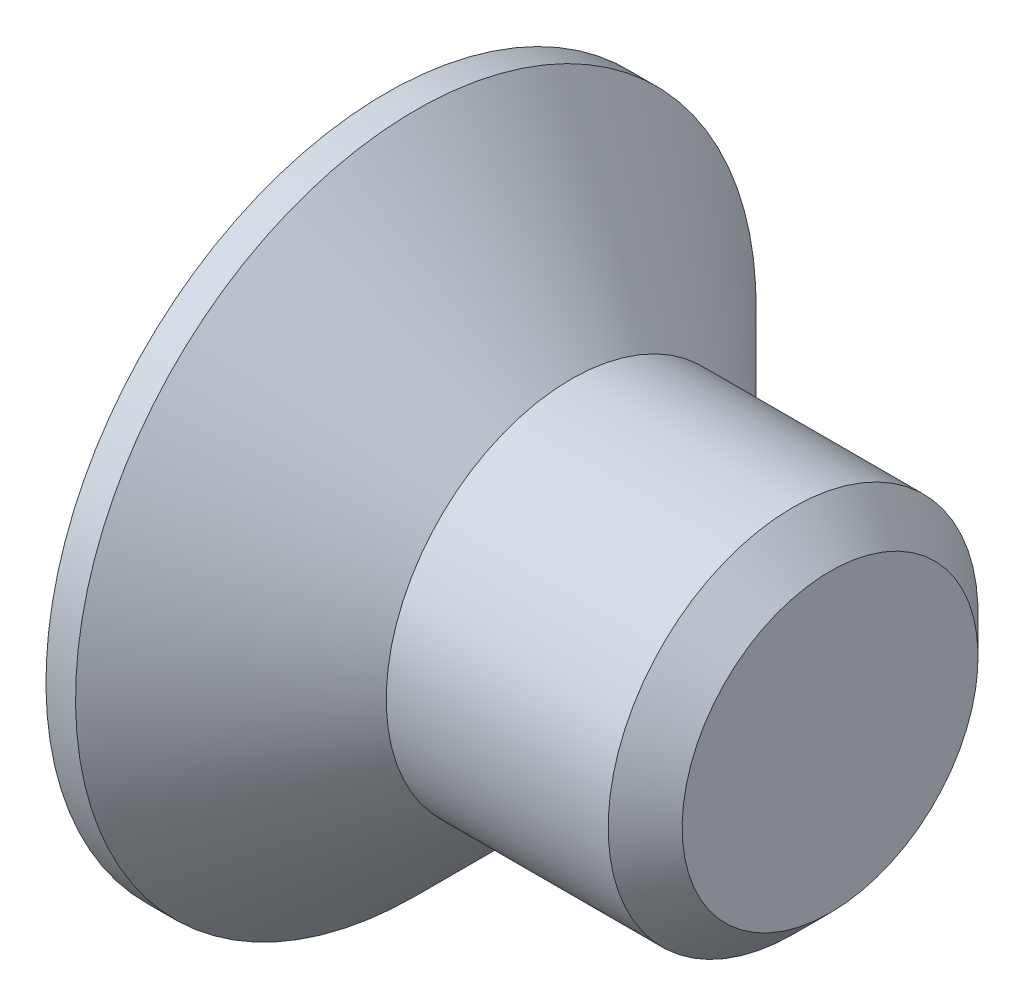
ISO-10303-21;
HEADER;
FILE_DESCRIPTION(('STEP AP214'),'2;1');
FILE_NAME('part.step','',(''),(''),'','','');
FILE_SCHEMA(('AUTOMOTIVE_DESIGN { 1 0 10303 214 1 1 1 1 }'));
ENDSEC;
DATA;
#1=APPLICATION_CONTEXT('core data for automotive mechanical design processes');
#2=APPLICATION_PROTOCOL_DEFINITION('international standard','automotive_design',2000,#1);
#3=PRODUCT_CONTEXT('',#1,'mechanical');
#4=PRODUCT('Part','Part','',(#3));
#5=PRODUCT_RELATED_PRODUCT_CATEGORY('part','',(#4));
#6=PRODUCT_DEFINITION_FORMATION('','',#4);
#7=PRODUCT_DEFINITION_CONTEXT('part definition',#1,'design');
#8=PRODUCT_DEFINITION('design','',#6,#7);
#9=PRODUCT_DEFINITION_SHAPE('','',#8);
#10=(LENGTH_UNIT() NAMED_UNIT(*) SI_UNIT(.MILLI.,.METRE.));
#11=(NAMED_UNIT(*) PLANE_ANGLE_UNIT() SI_UNIT($,.RADIAN.));
#12=(NAMED_UNIT(*) SI_UNIT($,.STERADIAN.) SOLID_ANGLE_UNIT());
#13=UNCERTAINTY_MEASURE_WITH_UNIT(LENGTH_MEASURE(1.E-05),#10,'distance_accuracy_value','');
#14=(GEOMETRIC_REPRESENTATION_CONTEXT(3) GLOBAL_UNCERTAINTY_ASSIGNED_CONTEXT((#13)) GLOBAL_UNIT_ASSIGNED_CONTEXT((#10,
#11,#12)) REPRESENTATION_CONTEXT('',''));
#15=CARTESIAN_POINT('',(0.,0.,0.));
#16=DIRECTION('',(0.,0.,1.));
#17=DIRECTION('',(1.,0.,0.));
#18=AXIS2_PLACEMENT_3D('',#15,#16,#17);
#19=CARTESIAN_POINT('',(0.,0.,0.));
#20=DIRECTION('',(-1.,0.,0.));
#21=DIRECTION('',(0.,-1.,0.));
#22=AXIS2_PLACEMENT_3D('',#19,#20,#21);
#23=CONICAL_SURFACE('',#22,2.5,0.78539816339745);
#24=CARTESIAN_POINT('',(-2.09999999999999,0.,0.));
#25=DIRECTION('',(-1.,0.,0.));
#26=DIRECTION('',(0.,-1.,0.));
#27=AXIS2_PLACEMENT_3D('',#24,#25,#26);
#28=CIRCLE('',#27,4.6);
#29=CARTESIAN_POINT('',(-2.09999999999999,-4.6,0.));
#30=VERTEX_POINT('',#29);
#31=EDGE_CURVE('E189',#30,#30,#28,.T.);
#32=ORIENTED_EDGE('',*,*,#31,.F.);
#33=EDGE_LOOP('',(#32));
#34=FACE_BOUND('',#33,.T.);
#35=CARTESIAN_POINT('',(0.,0.,0.));
#36=DIRECTION('',(-1.,0.,0.));
#37=DIRECTION('',(0.,-1.,0.));
#38=AXIS2_PLACEMENT_3D('',#35,#36,#37);
#39=CIRCLE('',#38,2.5);
#40=CARTESIAN_POINT('',(0.,-2.5,0.));
#41=VERTEX_POINT('',#40);
#42=EDGE_CURVE('E212',#41,#41,#39,.T.);
#43=ORIENTED_EDGE('',*,*,#42,.T.);
#44=EDGE_LOOP('',(#43));
#45=FACE_BOUND('',#44,.T.);
#46=ADVANCED_FACE('F33',(#34,#45),#23,.T.);
#47=CARTESIAN_POINT('',(-2.5,0.,0.));
#48=DIRECTION('',(-1.,0.,0.));
#49=DIRECTION('',(0.,-1.,0.));
#50=AXIS2_PLACEMENT_3D('',#47,#48,#49);
#51=CYLINDRICAL_SURFACE('',#50,2.5);
#52=CARTESIAN_POINT('',(3.,0.,0.));
#53=DIRECTION('',(-1.,0.,0.));
#54=DIRECTION('',(0.,-1.,0.));
#55=AXIS2_PLACEMENT_3D('',#52,#53,#54);
#56=CIRCLE('',#55,2.5);
#57=CARTESIAN_POINT('',(3.,-2.5,0.));
#58=VERTEX_POINT('',#57);
#59=EDGE_CURVE('E41',#58,#58,#56,.T.);
#60=ORIENTED_EDGE('',*,*,#59,.T.);
#61=EDGE_LOOP('',(#60));
#62=FACE_BOUND('',#61,.T.);
#63=ORIENTED_EDGE('',*,*,#42,.F.);
#64=EDGE_LOOP('',(#63));
#65=FACE_BOUND('',#64,.T.);
#66=ADVANCED_FACE('F217',(#62,#65),#51,.T.);
#67=CARTESIAN_POINT('',(3.5,0.,0.));
#68=DIRECTION('',(-1.,0.,0.));
#69=DIRECTION('',(0.,-1.,0.));
#70=AXIS2_PLACEMENT_3D('',#67,#68,#69);
#71=PLANE('',#70);
#72=CARTESIAN_POINT('',(3.5,0.,0.));
#73=DIRECTION('',(-1.,0.,0.));
#74=DIRECTION('',(0.,-1.,0.));
#75=AXIS2_PLACEMENT_3D('',#72,#73,#74);
#76=CIRCLE('',#75,2.);
#77=CARTESIAN_POINT('',(3.5,-2.,0.));
#78=VERTEX_POINT('',#77);
#79=EDGE_CURVE('E11',#78,#78,#76,.F.);
#80=ORIENTED_EDGE('',*,*,#79,.T.);
#81=EDGE_LOOP('',(#80));
#82=FACE_BOUND('',#81,.T.);
#83=ADVANCED_FACE('F239',(#82),#71,.F.);
#84=CARTESIAN_POINT('',(-2.5,4.6,0.));
#85=DIRECTION('',(1.,0.,0.));
#86=DIRECTION('',(0.,1.,0.));
#87=AXIS2_PLACEMENT_3D('',#84,#85,#86);
#88=PLANE('',#87);
#89=DIRECTION('',(0.,0.,-1.));
#90=VECTOR('',#89,1.);
#91=CARTESIAN_POINT('',(-2.5,0.575,-2.3));
#92=LINE('',#91,#90);
#93=CARTESIAN_POINT('',(-2.5,0.575,-0.575));
#94=VERTEX_POINT('',#93);
#95=CARTESIAN_POINT('',(-2.5,0.575,-2.3));
#96=VERTEX_POINT('',#95);
#97=EDGE_CURVE('E158',#94,#96,#92,.T.);
#98=ORIENTED_EDGE('',*,*,#97,.F.);
#99=DIRECTION('',(0.,-1.,0.));
#100=VECTOR('',#99,1.);
#101=CARTESIAN_POINT('',(-2.5,0.575,-0.575));
#102=LINE('',#101,#100);
#103=CARTESIAN_POINT('',(-2.5,2.3,-0.575));
#104=VERTEX_POINT('',#103);
#105=EDGE_CURVE('E48',#104,#94,#102,.T.);
#106=ORIENTED_EDGE('',*,*,#105,.F.);
#107=DIRECTION('',(0.,0.,-1.));
#108=VECTOR('',#107,1.);
#109=CARTESIAN_POINT('',(-2.5,2.3,-0.575));
#110=LINE('',#109,#108);
#111=CARTESIAN_POINT('',(-2.5,2.3,0.575));
#112=VERTEX_POINT('',#111);
#113=EDGE_CURVE('E185',#112,#104,#110,.T.);
#114=ORIENTED_EDGE('',*,*,#113,.F.);
#115=DIRECTION('',(0.,1.,0.));
#116=VECTOR('',#115,1.);
#117=CARTESIAN_POINT('',(-2.5,2.3,0.575));
#118=LINE('',#117,#116);
#119=CARTESIAN_POINT('',(-2.5,0.575,0.575));
#120=VERTEX_POINT('',#119);
#121=EDGE_CURVE('E183',#120,#112,#118,.T.);
#122=ORIENTED_EDGE('',*,*,#121,.F.);
#123=DIRECTION('',(0.,0.,-1.));
#124=VECTOR('',#123,1.);
#125=CARTESIAN_POINT('',(-2.5,0.575,0.575));
#126=LINE('',#125,#124);
#127=CARTESIAN_POINT('',(-2.5,0.575,2.3));
#128=VERTEX_POINT('',#127);
#129=EDGE_CURVE('E132',#128,#120,#126,.T.);
#130=ORIENTED_EDGE('',*,*,#129,.F.);
#131=DIRECTION('',(0.,1.,0.));
#132=VECTOR('',#131,1.);
#133=CARTESIAN_POINT('',(-2.5,0.575,2.3));
#134=LINE('',#133,#132);
#135=CARTESIAN_POINT('',(-2.5,-0.575,2.3));
#136=VERTEX_POINT('',#135);
#137=EDGE_CURVE('E179',#136,#128,#134,.T.);
#138=ORIENTED_EDGE('',*,*,#137,.F.);
#139=DIRECTION('',(0.,0.,1.));
#140=VECTOR('',#139,1.);
#141=CARTESIAN_POINT('',(-2.5,-0.575,2.3));
#142=LINE('',#141,#140);
#143=CARTESIAN_POINT('',(-2.5,-0.575,0.575));
#144=VERTEX_POINT('',#143);
#145=EDGE_CURVE('E176',#144,#136,#142,.T.);
#146=ORIENTED_EDGE('',*,*,#145,.F.);
#147=DIRECTION('',(0.,1.,0.));
#148=VECTOR('',#147,1.);
#149=CARTESIAN_POINT('',(-2.5,-0.575,0.575));
#150=LINE('',#149,#148);
#151=CARTESIAN_POINT('',(-2.5,-2.3,0.575));
#152=VERTEX_POINT('',#151);
#153=EDGE_CURVE('E173',#152,#144,#150,.T.);
#154=ORIENTED_EDGE('',*,*,#153,.F.);
#155=DIRECTION('',(0.,0.,1.));
#156=VECTOR('',#155,1.);
#157=CARTESIAN_POINT('',(-2.5,-2.3,0.575));
#158=LINE('',#157,#156);
#159=CARTESIAN_POINT('',(-2.5,-2.3,-0.575));
#160=VERTEX_POINT('',#159);
#161=EDGE_CURVE('E170',#160,#152,#158,.T.);
#162=ORIENTED_EDGE('',*,*,#161,.F.);
#163=DIRECTION('',(0.,-1.,0.));
#164=VECTOR('',#163,1.);
#165=CARTESIAN_POINT('',(-2.5,-2.3,-0.575));
#166=LINE('',#165,#164);
#167=CARTESIAN_POINT('',(-2.5,-0.575,-0.575));
#168=VERTEX_POINT('',#167);
#169=EDGE_CURVE('E167',#168,#160,#166,.T.);
#170=ORIENTED_EDGE('',*,*,#169,.F.);
#171=DIRECTION('',(0.,0.,1.));
#172=VECTOR('',#171,1.);
#173=CARTESIAN_POINT('',(-2.5,-0.575,-0.575));
#174=LINE('',#173,#172);
#175=CARTESIAN_POINT('',(-2.5,-0.575,-2.3));
#176=VERTEX_POINT('',#175);
#177=EDGE_CURVE('E164',#176,#168,#174,.T.);
#178=ORIENTED_EDGE('',*,*,#177,.F.);
#179=DIRECTION('',(0.,-1.,0.));
#180=VECTOR('',#179,1.);
#181=CARTESIAN_POINT('',(-2.5,-0.575,-2.3));
#182=LINE('',#181,#180);
#183=EDGE_CURVE('E161',#96,#176,#182,.T.);
#184=ORIENTED_EDGE('',*,*,#183,.F.);
#185=EDGE_LOOP('',(#98,#106,#114,#122,#130,#138,#146,#154,#162,#170,#178,#184));
#186=FACE_BOUND('',#185,.T.);
#187=CARTESIAN_POINT('',(-2.5,0.,0.));
#188=DIRECTION('',(-1.,0.,0.));
#189=DIRECTION('',(0.,-1.,0.));
#190=AXIS2_PLACEMENT_3D('',#187,#188,#189);
#191=CIRCLE('',#190,4.6);
#192=CARTESIAN_POINT('',(-2.5,-4.6,0.));
#193=VERTEX_POINT('',#192);
#194=EDGE_CURVE('E209',#193,#193,#191,.T.);
#195=ORIENTED_EDGE('',*,*,#194,.T.);
#196=EDGE_LOOP('',(#195));
#197=FACE_BOUND('',#196,.T.);
#198=ADVANCED_FACE('F230',(#186,#197),#88,.F.);
#199=CARTESIAN_POINT('',(-2.5,0.,0.));
#200=DIRECTION('',(-1.,0.,0.));
#201=DIRECTION('',(0.,-1.,0.));
#202=AXIS2_PLACEMENT_3D('',#199,#200,#201);
#203=CYLINDRICAL_SURFACE('',#202,4.6);
#204=ORIENTED_EDGE('',*,*,#194,.F.);
#205=EDGE_LOOP('',(#204));
#206=FACE_BOUND('',#205,.T.);
#207=ORIENTED_EDGE('',*,*,#31,.T.);
#208=EDGE_LOOP('',(#207));
#209=FACE_BOUND('',#208,.T.);
#210=ADVANCED_FACE('F222',(#206,#209),#203,.T.);
#211=CARTESIAN_POINT('',(3.,0.,0.));
#212=DIRECTION('',(-1.,0.,0.));
#213=DIRECTION('',(0.,-1.,0.));
#214=AXIS2_PLACEMENT_3D('',#211,#212,#213);
#215=CONICAL_SURFACE('',#214,2.5,0.785398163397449);
#216=ORIENTED_EDGE('',*,*,#79,.F.);
#217=EDGE_LOOP('',(#216));
#218=FACE_BOUND('',#217,.T.);
#219=ORIENTED_EDGE('',*,*,#59,.F.);
#220=EDGE_LOOP('',(#219));
#221=FACE_BOUND('',#220,.T.);
#222=ADVANCED_FACE('F35',(#218,#221),#215,.T.);
#223=CARTESIAN_POINT('',(-0.4,0.575,-0.575));
#224=DIRECTION('',(0.,0.,-1.));
#225=DIRECTION('',(-1.,0.,0.));
#226=AXIS2_PLACEMENT_3D('',#223,#224,#225);
#227=PLANE('',#226);
#228=ORIENTED_EDGE('',*,*,#105,.T.);
#229=DIRECTION('',(-1.,0.,0.));
#230=VECTOR('',#229,1.);
#231=CARTESIAN_POINT('',(-0.4,0.575,-0.575));
#232=LINE('',#231,#230);
#233=CARTESIAN_POINT('',(-0.4,0.575,-0.575));
#234=VERTEX_POINT('',#233);
#235=EDGE_CURVE('E96',#234,#94,#232,.T.);
#236=ORIENTED_EDGE('',*,*,#235,.F.);
#237=DIRECTION('',(0.,-1.,0.));
#238=VECTOR('',#237,1.);
#239=CARTESIAN_POINT('',(-0.4,0.575,-0.575));
#240=LINE('',#239,#238);
#241=CARTESIAN_POINT('',(-0.4,2.3,-0.575));
#242=VERTEX_POINT('',#241);
#243=EDGE_CURVE('E187',#242,#234,#240,.T.);
#244=ORIENTED_EDGE('',*,*,#243,.F.);
#245=DIRECTION('',(-1.,0.,0.));
#246=VECTOR('',#245,1.);
#247=CARTESIAN_POINT('',(-0.4,2.3,-0.575));
#248=LINE('',#247,#246);
#249=EDGE_CURVE('E56',#242,#104,#248,.T.);
#250=ORIENTED_EDGE('',*,*,#249,.T.);
#251=EDGE_LOOP('',(#228,#236,#244,#250));
#252=FACE_BOUND('',#251,.T.);
#253=ADVANCED_FACE('F221',(#252),#227,.F.);
#254=CARTESIAN_POINT('',(-0.4,2.3,-0.575));
#255=DIRECTION('',(0.,1.,0.));
#256=DIRECTION('',(-1.,0.,0.));
#257=AXIS2_PLACEMENT_3D('',#254,#255,#256);
#258=PLANE('',#257);
#259=ORIENTED_EDGE('',*,*,#113,.T.);
#260=ORIENTED_EDGE('',*,*,#249,.F.);
#261=DIRECTION('',(0.,0.,-1.));
#262=VECTOR('',#261,1.);
#263=CARTESIAN_POINT('',(-0.4,2.3,-0.575));
#264=LINE('',#263,#262);
#265=CARTESIAN_POINT('',(-0.4,2.3,0.575));
#266=VERTEX_POINT('',#265);
#267=EDGE_CURVE('E144',#266,#242,#264,.T.);
#268=ORIENTED_EDGE('',*,*,#267,.F.);
#269=DIRECTION('',(-1.,0.,0.));
#270=VECTOR('',#269,1.);
#271=CARTESIAN_POINT('',(-0.4,2.3,0.575));
#272=LINE('',#271,#270);
#273=EDGE_CURVE('E136',#266,#112,#272,.T.);
#274=ORIENTED_EDGE('',*,*,#273,.T.);
#275=EDGE_LOOP('',(#259,#260,#268,#274));
#276=FACE_BOUND('',#275,.T.);
#277=ADVANCED_FACE('F228',(#276),#258,.F.);
#278=CARTESIAN_POINT('',(-0.4,2.3,0.575));
#279=DIRECTION('',(0.,0.,1.));
#280=DIRECTION('',(1.,0.,0.));
#281=AXIS2_PLACEMENT_3D('',#278,#279,#280);
#282=PLANE('',#281);
#283=ORIENTED_EDGE('',*,*,#121,.T.);
#284=ORIENTED_EDGE('',*,*,#273,.F.);
#285=DIRECTION('',(0.,1.,0.));
#286=VECTOR('',#285,1.);
#287=CARTESIAN_POINT('',(-0.4,2.3,0.575));
#288=LINE('',#287,#286);
#289=CARTESIAN_POINT('',(-0.4,0.575,0.575));
#290=VERTEX_POINT('',#289);
#291=EDGE_CURVE('E140',#290,#266,#288,.T.);
#292=ORIENTED_EDGE('',*,*,#291,.F.);
#293=DIRECTION('',(-1.,0.,0.));
#294=VECTOR('',#293,1.);
#295=CARTESIAN_POINT('',(-0.4,0.575,0.575));
#296=LINE('',#295,#294);
#297=EDGE_CURVE('E125',#290,#120,#296,.T.);
#298=ORIENTED_EDGE('',*,*,#297,.T.);
#299=EDGE_LOOP('',(#283,#284,#292,#298));
#300=FACE_BOUND('',#299,.T.);
#301=ADVANCED_FACE('F141',(#300),#282,.F.);
#302=CARTESIAN_POINT('',(-0.4,0.575,0.575));
#303=DIRECTION('',(0.,1.,0.));
#304=DIRECTION('',(-1.,0.,0.));
#305=AXIS2_PLACEMENT_3D('',#302,#303,#304);
#306=PLANE('',#305);
#307=ORIENTED_EDGE('',*,*,#129,.T.);
#308=ORIENTED_EDGE('',*,*,#297,.F.);
#309=DIRECTION('',(0.,0.,-1.));
#310=VECTOR('',#309,1.);
#311=CARTESIAN_POINT('',(-0.4,0.575,0.575));
#312=LINE('',#311,#310);
#313=CARTESIAN_POINT('',(-0.4,0.575,2.3));
#314=VERTEX_POINT('',#313);
#315=EDGE_CURVE('E129',#314,#290,#312,.T.);
#316=ORIENTED_EDGE('',*,*,#315,.F.);
#317=DIRECTION('',(-1.,0.,0.));
#318=VECTOR('',#317,1.);
#319=CARTESIAN_POINT('',(-0.4,0.575,2.3));
#320=LINE('',#319,#318);
#321=EDGE_CURVE('E137',#314,#128,#320,.T.);
#322=ORIENTED_EDGE('',*,*,#321,.T.);
#323=EDGE_LOOP('',(#307,#308,#316,#322));
#324=FACE_BOUND('',#323,.T.);
#325=ADVANCED_FACE('F127',(#324),#306,.F.);
#326=CARTESIAN_POINT('',(-0.4,0.575,2.3));
#327=DIRECTION('',(0.,0.,1.));
#328=DIRECTION('',(1.,0.,0.));
#329=AXIS2_PLACEMENT_3D('',#326,#327,#328);
#330=PLANE('',#329);
#331=ORIENTED_EDGE('',*,*,#137,.T.);
#332=ORIENTED_EDGE('',*,*,#321,.F.);
#333=DIRECTION('',(0.,1.,0.));
#334=VECTOR('',#333,1.);
#335=CARTESIAN_POINT('',(-0.4,0.575,2.3));
#336=LINE('',#335,#334);
#337=CARTESIAN_POINT('',(-0.4,-0.575,2.3));
#338=VERTEX_POINT('',#337);
#339=EDGE_CURVE('E150',#338,#314,#336,.T.);
#340=ORIENTED_EDGE('',*,*,#339,.F.);
#341=DIRECTION('',(-1.,0.,0.));
#342=VECTOR('',#341,1.);
#343=CARTESIAN_POINT('',(-0.4,-0.575,2.3));
#344=LINE('',#343,#342);
#345=EDGE_CURVE('E192',#338,#136,#344,.T.);
#346=ORIENTED_EDGE('',*,*,#345,.T.);
#347=EDGE_LOOP('',(#331,#332,#340,#346));
#348=FACE_BOUND('',#347,.T.);
#349=ADVANCED_FACE('F277',(#348),#330,.F.);
#350=CARTESIAN_POINT('',(-0.4,-0.575,2.3));
#351=DIRECTION('',(0.,-1.,0.));
#352=DIRECTION('',(1.,0.,0.));
#353=AXIS2_PLACEMENT_3D('',#350,#351,#352);
#354=PLANE('',#353);
#355=ORIENTED_EDGE('',*,*,#145,.T.);
#356=ORIENTED_EDGE('',*,*,#345,.F.);
#357=DIRECTION('',(0.,0.,1.));
#358=VECTOR('',#357,1.);
#359=CARTESIAN_POINT('',(-0.4,-0.575,2.3));
#360=LINE('',#359,#358);
#361=CARTESIAN_POINT('',(-0.4,-0.575,0.575));
#362=VERTEX_POINT('',#361);
#363=EDGE_CURVE('E152',#362,#338,#360,.T.);
#364=ORIENTED_EDGE('',*,*,#363,.F.);
#365=DIRECTION('',(-1.,0.,0.));
#366=VECTOR('',#365,1.);
#367=CARTESIAN_POINT('',(-0.4,-0.575,0.575));
#368=LINE('',#367,#366);
#369=EDGE_CURVE('E194',#362,#144,#368,.T.);
#370=ORIENTED_EDGE('',*,*,#369,.T.);
#371=EDGE_LOOP('',(#355,#356,#364,#370));
#372=FACE_BOUND('',#371,.T.);
#373=ADVANCED_FACE('F273',(#372),#354,.F.);
#374=CARTESIAN_POINT('',(-0.4,-0.575,0.575));
#375=DIRECTION('',(0.,0.,1.));
#376=DIRECTION('',(1.,0.,0.));
#377=AXIS2_PLACEMENT_3D('',#374,#375,#376);
#378=PLANE('',#377);
#379=ORIENTED_EDGE('',*,*,#153,.T.);
#380=ORIENTED_EDGE('',*,*,#369,.F.);
#381=DIRECTION('',(0.,1.,0.));
#382=VECTOR('',#381,1.);
#383=CARTESIAN_POINT('',(-0.4,-0.575,0.575));
#384=LINE('',#383,#382);
#385=CARTESIAN_POINT('',(-0.4,-2.3,0.575));
#386=VERTEX_POINT('',#385);
#387=EDGE_CURVE('E422',#386,#362,#384,.T.);
#388=ORIENTED_EDGE('',*,*,#387,.F.);
#389=DIRECTION('',(-1.,0.,0.));
#390=VECTOR('',#389,1.);
#391=CARTESIAN_POINT('',(-0.4,-2.3,0.575));
#392=LINE('',#391,#390);
#393=EDGE_CURVE('E196',#386,#152,#392,.T.);
#394=ORIENTED_EDGE('',*,*,#393,.T.);
#395=EDGE_LOOP('',(#379,#380,#388,#394));
#396=FACE_BOUND('',#395,.T.);
#397=ADVANCED_FACE('F269',(#396),#378,.F.);
#398=CARTESIAN_POINT('',(-0.4,-2.3,0.575));
#399=DIRECTION('',(0.,-1.,0.));
#400=DIRECTION('',(1.,0.,0.));
#401=AXIS2_PLACEMENT_3D('',#398,#399,#400);
#402=PLANE('',#401);
#403=ORIENTED_EDGE('',*,*,#161,.T.);
#404=ORIENTED_EDGE('',*,*,#393,.F.);
#405=DIRECTION('',(0.,0.,1.));
#406=VECTOR('',#405,1.);
#407=CARTESIAN_POINT('',(-0.4,-2.3,0.575));
#408=LINE('',#407,#406);
#409=CARTESIAN_POINT('',(-0.4,-2.3,-0.575));
#410=VERTEX_POINT('',#409);
#411=EDGE_CURVE('E419',#410,#386,#408,.T.);
#412=ORIENTED_EDGE('',*,*,#411,.F.);
#413=DIRECTION('',(-1.,0.,0.));
#414=VECTOR('',#413,1.);
#415=CARTESIAN_POINT('',(-0.4,-2.3,-0.575));
#416=LINE('',#415,#414);
#417=EDGE_CURVE('E198',#410,#160,#416,.T.);
#418=ORIENTED_EDGE('',*,*,#417,.T.);
#419=EDGE_LOOP('',(#403,#404,#412,#418));
#420=FACE_BOUND('',#419,.T.);
#421=ADVANCED_FACE('F265',(#420),#402,.F.);
#422=CARTESIAN_POINT('',(-0.4,-2.3,-0.575));
#423=DIRECTION('',(0.,0.,-1.));
#424=DIRECTION('',(-1.,0.,0.));
#425=AXIS2_PLACEMENT_3D('',#422,#423,#424);
#426=PLANE('',#425);
#427=ORIENTED_EDGE('',*,*,#169,.T.);
#428=ORIENTED_EDGE('',*,*,#417,.F.);
#429=DIRECTION('',(0.,-1.,0.));
#430=VECTOR('',#429,1.);
#431=CARTESIAN_POINT('',(-0.4,-2.3,-0.575));
#432=LINE('',#431,#430);
#433=CARTESIAN_POINT('',(-0.4,-0.575,-0.575));
#434=VERTEX_POINT('',#433);
#435=EDGE_CURVE('E416',#434,#410,#432,.T.);
#436=ORIENTED_EDGE('',*,*,#435,.F.);
#437=DIRECTION('',(-1.,0.,0.));
#438=VECTOR('',#437,1.);
#439=CARTESIAN_POINT('',(-0.4,-0.575,-0.575));
#440=LINE('',#439,#438);
#441=EDGE_CURVE('E200',#434,#168,#440,.T.);
#442=ORIENTED_EDGE('',*,*,#441,.T.);
#443=EDGE_LOOP('',(#427,#428,#436,#442));
#444=FACE_BOUND('',#443,.T.);
#445=ADVANCED_FACE('F261',(#444),#426,.F.);
#446=CARTESIAN_POINT('',(-0.4,-0.575,-0.575));
#447=DIRECTION('',(0.,-1.,0.));
#448=DIRECTION('',(1.,0.,0.));
#449=AXIS2_PLACEMENT_3D('',#446,#447,#448);
#450=PLANE('',#449);
#451=ORIENTED_EDGE('',*,*,#177,.T.);
#452=ORIENTED_EDGE('',*,*,#441,.F.);
#453=DIRECTION('',(0.,0.,1.));
#454=VECTOR('',#453,1.);
#455=CARTESIAN_POINT('',(-0.4,-0.575,-0.575));
#456=LINE('',#455,#454);
#457=CARTESIAN_POINT('',(-0.4,-0.575,-2.3));
#458=VERTEX_POINT('',#457);
#459=EDGE_CURVE('E413',#458,#434,#456,.T.);
#460=ORIENTED_EDGE('',*,*,#459,.F.);
#461=DIRECTION('',(-1.,0.,0.));
#462=VECTOR('',#461,1.);
#463=CARTESIAN_POINT('',(-0.4,-0.575,-2.3));
#464=LINE('',#463,#462);
#465=EDGE_CURVE('E202',#458,#176,#464,.T.);
#466=ORIENTED_EDGE('',*,*,#465,.T.);
#467=EDGE_LOOP('',(#451,#452,#460,#466));
#468=FACE_BOUND('',#467,.T.);
#469=ADVANCED_FACE('F257',(#468),#450,.F.);
#470=CARTESIAN_POINT('',(-0.4,-0.575,-2.3));
#471=DIRECTION('',(0.,0.,-1.));
#472=DIRECTION('',(-1.,0.,0.));
#473=AXIS2_PLACEMENT_3D('',#470,#471,#472);
#474=PLANE('',#473);
#475=ORIENTED_EDGE('',*,*,#183,.T.);
#476=ORIENTED_EDGE('',*,*,#465,.F.);
#477=DIRECTION('',(0.,-1.,0.));
#478=VECTOR('',#477,1.);
#479=CARTESIAN_POINT('',(-0.4,-0.575,-2.3));
#480=LINE('',#479,#478);
#481=CARTESIAN_POINT('',(-0.4,0.575,-2.3));
#482=VERTEX_POINT('',#481);
#483=EDGE_CURVE('E408',#482,#458,#480,.T.);
#484=ORIENTED_EDGE('',*,*,#483,.F.);
#485=DIRECTION('',(-1.,0.,0.));
#486=VECTOR('',#485,1.);
#487=CARTESIAN_POINT('',(-0.4,0.575,-2.3));
#488=LINE('',#487,#486);
#489=EDGE_CURVE('E204',#482,#96,#488,.T.);
#490=ORIENTED_EDGE('',*,*,#489,.T.);
#491=EDGE_LOOP('',(#475,#476,#484,#490));
#492=FACE_BOUND('',#491,.T.);
#493=ADVANCED_FACE('F253',(#492),#474,.F.);
#494=CARTESIAN_POINT('',(-0.4,0.575,-2.3));
#495=DIRECTION('',(0.,1.,0.));
#496=DIRECTION('',(-1.,0.,0.));
#497=AXIS2_PLACEMENT_3D('',#494,#495,#496);
#498=PLANE('',#497);
#499=ORIENTED_EDGE('',*,*,#97,.T.);
#500=ORIENTED_EDGE('',*,*,#489,.F.);
#501=DIRECTION('',(0.,0.,-1.));
#502=VECTOR('',#501,1.);
#503=CARTESIAN_POINT('',(-0.4,0.575,-2.3));
#504=LINE('',#503,#502);
#505=EDGE_CURVE('E406',#234,#482,#504,.T.);
#506=ORIENTED_EDGE('',*,*,#505,.F.);
#507=ORIENTED_EDGE('',*,*,#235,.T.);
#508=EDGE_LOOP('',(#499,#500,#506,#507));
#509=FACE_BOUND('',#508,.T.);
#510=ADVANCED_FACE('F250',(#509),#498,.F.);
#511=CARTESIAN_POINT('',(-0.4,0.,0.));
#512=DIRECTION('',(1.,0.,0.));
#513=DIRECTION('',(0.,0.,-1.));
#514=AXIS2_PLACEMENT_3D('',#511,#512,#513);
#515=PLANE('',#514);
#516=ORIENTED_EDGE('',*,*,#243,.T.);
#517=ORIENTED_EDGE('',*,*,#505,.T.);
#518=ORIENTED_EDGE('',*,*,#483,.T.);
#519=ORIENTED_EDGE('',*,*,#459,.T.);
#520=ORIENTED_EDGE('',*,*,#435,.T.);
#521=ORIENTED_EDGE('',*,*,#411,.T.);
#522=ORIENTED_EDGE('',*,*,#387,.T.);
#523=ORIENTED_EDGE('',*,*,#363,.T.);
#524=ORIENTED_EDGE('',*,*,#339,.T.);
#525=ORIENTED_EDGE('',*,*,#315,.T.);
#526=ORIENTED_EDGE('',*,*,#291,.T.);
#527=ORIENTED_EDGE('',*,*,#267,.T.);
#528=EDGE_LOOP('',(#516,#517,#518,#519,#520,#521,#522,#523,#524,#525,#526,#527));
#529=FACE_BOUND('',#528,.T.);
#530=ADVANCED_FACE('F147',(#529),#515,.F.);
#531=CLOSED_SHELL('',(#46,#66,#83,#198,#210,#222,#253,#277,#301,#325,#349,#373,#397,#421,#445,
#469,#493,#510,#530));
#532=MANIFOLD_SOLID_BREP('B2',#531);
#533=ADVANCED_BREP_SHAPE_REPRESENTATION('',(#18,#532),#14);
#534=SHAPE_DEFINITION_REPRESENTATION(#9,#533);
ENDSEC;
END-ISO-10303-21;
